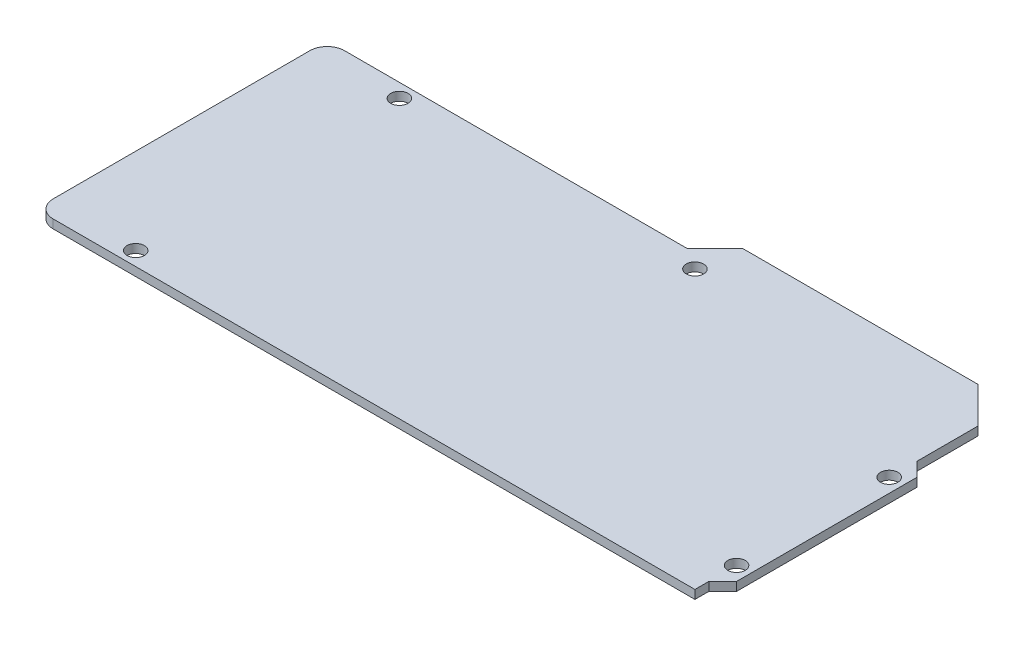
ISO-10303-21;
HEADER;
FILE_DESCRIPTION(('STEP AP214'),'2;1');
FILE_NAME('part.step','',(''),(''),'','','');
FILE_SCHEMA(('AUTOMOTIVE_DESIGN { 1 0 10303 214 1 1 1 1 }'));
ENDSEC;
DATA;
#1=APPLICATION_CONTEXT('core data for automotive mechanical design processes');
#2=APPLICATION_PROTOCOL_DEFINITION('international standard','automotive_design',2000,#1);
#3=PRODUCT_CONTEXT('',#1,'mechanical');
#4=PRODUCT('Part','Part','',(#3));
#5=PRODUCT_RELATED_PRODUCT_CATEGORY('part','',(#4));
#6=PRODUCT_DEFINITION_FORMATION('','',#4);
#7=PRODUCT_DEFINITION_CONTEXT('part definition',#1,'design');
#8=PRODUCT_DEFINITION('design','',#6,#7);
#9=PRODUCT_DEFINITION_SHAPE('','',#8);
#10=(LENGTH_UNIT() NAMED_UNIT(*) SI_UNIT(.MILLI.,.METRE.));
#11=(NAMED_UNIT(*) PLANE_ANGLE_UNIT() SI_UNIT($,.RADIAN.));
#12=(NAMED_UNIT(*) SI_UNIT($,.STERADIAN.) SOLID_ANGLE_UNIT());
#13=UNCERTAINTY_MEASURE_WITH_UNIT(LENGTH_MEASURE(1.E-05),#10,'distance_accuracy_value','');
#14=(GEOMETRIC_REPRESENTATION_CONTEXT(3) GLOBAL_UNCERTAINTY_ASSIGNED_CONTEXT((#13)) GLOBAL_UNIT_ASSIGNED_CONTEXT((#10,
#11,#12)) REPRESENTATION_CONTEXT('',''));
#15=CARTESIAN_POINT('',(0.,0.,0.));
#16=DIRECTION('',(0.,0.,1.));
#17=DIRECTION('',(1.,0.,0.));
#18=AXIS2_PLACEMENT_3D('',#15,#16,#17);
#19=CARTESIAN_POINT('',(3.175,1.5875,-3.175));
#20=DIRECTION('',(0.,-1.,0.));
#21=DIRECTION('',(0.,0.,-1.));
#22=AXIS2_PLACEMENT_3D('',#19,#20,#21);
#23=CYLINDRICAL_SURFACE('',#22,3.175);
#24=CARTESIAN_POINT('',(3.175,0.,-3.175));
#25=DIRECTION('',(0.,1.,0.));
#26=DIRECTION('',(0.,0.,-1.));
#27=AXIS2_PLACEMENT_3D('',#24,#25,#26);
#28=CIRCLE('',#27,3.175);
#29=CARTESIAN_POINT('',(0.,0.,-3.17500000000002));
#30=VERTEX_POINT('',#29);
#31=CARTESIAN_POINT('',(3.17500000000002,0.,0.));
#32=VERTEX_POINT('',#31);
#33=EDGE_CURVE('E157',#30,#32,#28,.T.);
#34=ORIENTED_EDGE('',*,*,#33,.T.);
#35=DIRECTION('',(0.,-1.,0.));
#36=VECTOR('',#35,1.);
#37=CARTESIAN_POINT('',(3.17500000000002,1.5875,0.));
#38=LINE('',#37,#36);
#39=CARTESIAN_POINT('',(3.17500000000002,1.5875,0.));
#40=VERTEX_POINT('',#39);
#41=EDGE_CURVE('E11',#40,#32,#38,.T.);
#42=ORIENTED_EDGE('',*,*,#41,.F.);
#43=CARTESIAN_POINT('',(3.175,1.5875,-3.175));
#44=DIRECTION('',(0.,1.,0.));
#45=DIRECTION('',(0.,0.,-1.));
#46=AXIS2_PLACEMENT_3D('',#43,#44,#45);
#47=CIRCLE('',#46,3.175);
#48=CARTESIAN_POINT('',(0.,1.5875,-3.17500000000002));
#49=VERTEX_POINT('',#48);
#50=EDGE_CURVE('E182',#49,#40,#47,.T.);
#51=ORIENTED_EDGE('',*,*,#50,.F.);
#52=DIRECTION('',(0.,-1.,0.));
#53=VECTOR('',#52,1.);
#54=CARTESIAN_POINT('',(0.,1.5875,-3.17500000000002));
#55=LINE('',#54,#53);
#56=EDGE_CURVE('E153',#49,#30,#55,.T.);
#57=ORIENTED_EDGE('',*,*,#56,.T.);
#58=EDGE_LOOP('',(#34,#42,#51,#57));
#59=FACE_BOUND('',#58,.T.);
#60=ADVANCED_FACE('F31',(#59),#23,.T.);
#61=CARTESIAN_POINT('',(3.17500000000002,1.5875,0.));
#62=DIRECTION('',(0.,0.,-1.));
#63=DIRECTION('',(-1.,0.,0.));
#64=AXIS2_PLACEMENT_3D('',#61,#62,#63);
#65=PLANE('',#64);
#66=DIRECTION('',(1.,0.,0.));
#67=VECTOR('',#66,1.);
#68=CARTESIAN_POINT('',(3.17500000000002,0.,0.));
#69=LINE('',#68,#67);
#70=CARTESIAN_POINT('',(120.65,0.,0.));
#71=VERTEX_POINT('',#70);
#72=EDGE_CURVE('E160',#32,#71,#69,.T.);
#73=ORIENTED_EDGE('',*,*,#72,.T.);
#74=DIRECTION('',(0.,-1.,0.));
#75=VECTOR('',#74,1.);
#76=CARTESIAN_POINT('',(120.65,1.5875,0.));
#77=LINE('',#76,#75);
#78=CARTESIAN_POINT('',(120.65,1.5875,0.));
#79=VERTEX_POINT('',#78);
#80=EDGE_CURVE('E39',#79,#71,#77,.T.);
#81=ORIENTED_EDGE('',*,*,#80,.F.);
#82=DIRECTION('',(1.,0.,0.));
#83=VECTOR('',#82,1.);
#84=CARTESIAN_POINT('',(3.17500000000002,1.5875,0.));
#85=LINE('',#84,#83);
#86=EDGE_CURVE('E105',#40,#79,#85,.T.);
#87=ORIENTED_EDGE('',*,*,#86,.F.);
#88=ORIENTED_EDGE('',*,*,#41,.T.);
#89=EDGE_LOOP('',(#73,#81,#87,#88));
#90=FACE_BOUND('',#89,.T.);
#91=ADVANCED_FACE('F266',(#90),#65,.F.);
#92=CARTESIAN_POINT('',(120.65,1.5875,0.));
#93=DIRECTION('',(-1.,0.,0.));
#94=DIRECTION('',(0.,0.,1.));
#95=AXIS2_PLACEMENT_3D('',#92,#93,#94);
#96=PLANE('',#95);
#97=DIRECTION('',(0.,0.,-1.));
#98=VECTOR('',#97,1.);
#99=CARTESIAN_POINT('',(120.65,0.,0.));
#100=LINE('',#99,#98);
#101=CARTESIAN_POINT('',(120.65,0.,-2.54));
#102=VERTEX_POINT('',#101);
#103=EDGE_CURVE('E163',#71,#102,#100,.T.);
#104=ORIENTED_EDGE('',*,*,#103,.T.);
#105=DIRECTION('',(0.,-1.,0.));
#106=VECTOR('',#105,1.);
#107=CARTESIAN_POINT('',(120.65,1.5875,-2.54));
#108=LINE('',#107,#106);
#109=CARTESIAN_POINT('',(120.65,1.5875,-2.54));
#110=VERTEX_POINT('',#109);
#111=EDGE_CURVE('E204',#110,#102,#108,.T.);
#112=ORIENTED_EDGE('',*,*,#111,.F.);
#113=DIRECTION('',(0.,0.,-1.));
#114=VECTOR('',#113,1.);
#115=CARTESIAN_POINT('',(120.65,1.5875,0.));
#116=LINE('',#115,#114);
#117=EDGE_CURVE('E212',#79,#110,#116,.T.);
#118=ORIENTED_EDGE('',*,*,#117,.F.);
#119=ORIENTED_EDGE('',*,*,#80,.T.);
#120=EDGE_LOOP('',(#104,#112,#118,#119));
#121=FACE_BOUND('',#120,.T.);
#122=ADVANCED_FACE('F210',(#121),#96,.F.);
#123=CARTESIAN_POINT('',(120.65,1.5875,-2.54));
#124=DIRECTION('',(-0.707106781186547,0.,-0.707106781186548));
#125=DIRECTION('',(-0.707106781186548,0.,0.707106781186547));
#126=AXIS2_PLACEMENT_3D('',#123,#124,#125);
#127=PLANE('',#126);
#128=DIRECTION('',(0.707106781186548,0.,-0.707106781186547));
#129=VECTOR('',#128,1.);
#130=CARTESIAN_POINT('',(120.65,0.,-2.54));
#131=LINE('',#130,#129);
#132=CARTESIAN_POINT('',(123.19,0.,-5.08));
#133=VERTEX_POINT('',#132);
#134=EDGE_CURVE('E165',#102,#133,#131,.T.);
#135=ORIENTED_EDGE('',*,*,#134,.T.);
#136=DIRECTION('',(0.,-1.,0.));
#137=VECTOR('',#136,1.);
#138=CARTESIAN_POINT('',(123.19,1.5875,-5.08));
#139=LINE('',#138,#137);
#140=CARTESIAN_POINT('',(123.19,1.5875,-5.08));
#141=VERTEX_POINT('',#140);
#142=EDGE_CURVE('E201',#141,#133,#139,.T.);
#143=ORIENTED_EDGE('',*,*,#142,.F.);
#144=DIRECTION('',(0.707106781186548,0.,-0.707106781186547));
#145=VECTOR('',#144,1.);
#146=CARTESIAN_POINT('',(120.65,1.5875,-2.54));
#147=LINE('',#146,#145);
#148=EDGE_CURVE('E230',#110,#141,#147,.T.);
#149=ORIENTED_EDGE('',*,*,#148,.F.);
#150=ORIENTED_EDGE('',*,*,#111,.T.);
#151=EDGE_LOOP('',(#135,#143,#149,#150));
#152=FACE_BOUND('',#151,.T.);
#153=ADVANCED_FACE('F221',(#152),#127,.F.);
#154=CARTESIAN_POINT('',(123.19,1.5875,-5.08));
#155=DIRECTION('',(-1.,0.,0.));
#156=DIRECTION('',(0.,0.,1.));
#157=AXIS2_PLACEMENT_3D('',#154,#155,#156);
#158=PLANE('',#157);
#159=DIRECTION('',(0.,0.,-1.));
#160=VECTOR('',#159,1.);
#161=CARTESIAN_POINT('',(123.19,0.,-5.08));
#162=LINE('',#161,#160);
#163=CARTESIAN_POINT('',(123.19,0.,-38.1));
#164=VERTEX_POINT('',#163);
#165=EDGE_CURVE('E167',#133,#164,#162,.T.);
#166=ORIENTED_EDGE('',*,*,#165,.T.);
#167=DIRECTION('',(0.,-1.,0.));
#168=VECTOR('',#167,1.);
#169=CARTESIAN_POINT('',(123.19,1.5875,-38.1));
#170=LINE('',#169,#168);
#171=CARTESIAN_POINT('',(123.19,1.5875,-38.1));
#172=VERTEX_POINT('',#171);
#173=EDGE_CURVE('E198',#172,#164,#170,.T.);
#174=ORIENTED_EDGE('',*,*,#173,.F.);
#175=DIRECTION('',(0.,0.,-1.));
#176=VECTOR('',#175,1.);
#177=CARTESIAN_POINT('',(123.19,1.5875,-5.08));
#178=LINE('',#177,#176);
#179=EDGE_CURVE('E227',#141,#172,#178,.T.);
#180=ORIENTED_EDGE('',*,*,#179,.F.);
#181=ORIENTED_EDGE('',*,*,#142,.T.);
#182=EDGE_LOOP('',(#166,#174,#180,#181));
#183=FACE_BOUND('',#182,.T.);
#184=ADVANCED_FACE('F225',(#183),#158,.F.);
#185=CARTESIAN_POINT('',(123.19,1.5875,-38.1));
#186=DIRECTION('',(-0.707106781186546,0.,0.707106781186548));
#187=DIRECTION('',(0.707106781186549,0.,0.707106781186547));
#188=AXIS2_PLACEMENT_3D('',#185,#186,#187);
#189=PLANE('',#188);
#190=DIRECTION('',(-0.707106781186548,0.,-0.707106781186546));
#191=VECTOR('',#190,1.);
#192=CARTESIAN_POINT('',(123.19,0.,-38.1));
#193=LINE('',#192,#191);
#194=CARTESIAN_POINT('',(120.65,0.,-40.64));
#195=VERTEX_POINT('',#194);
#196=EDGE_CURVE('E169',#164,#195,#193,.T.);
#197=ORIENTED_EDGE('',*,*,#196,.T.);
#198=DIRECTION('',(0.,-1.,0.));
#199=VECTOR('',#198,1.);
#200=CARTESIAN_POINT('',(120.65,1.5875,-40.64));
#201=LINE('',#200,#199);
#202=CARTESIAN_POINT('',(120.65,1.5875,-40.64));
#203=VERTEX_POINT('',#202);
#204=EDGE_CURVE('E195',#203,#195,#201,.T.);
#205=ORIENTED_EDGE('',*,*,#204,.F.);
#206=DIRECTION('',(-0.707106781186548,0.,-0.707106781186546));
#207=VECTOR('',#206,1.);
#208=CARTESIAN_POINT('',(123.19,1.5875,-38.1));
#209=LINE('',#208,#207);
#210=EDGE_CURVE('E229',#172,#203,#209,.T.);
#211=ORIENTED_EDGE('',*,*,#210,.F.);
#212=ORIENTED_EDGE('',*,*,#173,.T.);
#213=EDGE_LOOP('',(#197,#205,#211,#212));
#214=FACE_BOUND('',#213,.T.);
#215=ADVANCED_FACE('F279',(#214),#189,.F.);
#216=CARTESIAN_POINT('',(120.65,1.5875,-40.64));
#217=DIRECTION('',(-1.,0.,0.));
#218=DIRECTION('',(0.,0.,1.));
#219=AXIS2_PLACEMENT_3D('',#216,#217,#218);
#220=PLANE('',#219);
#221=DIRECTION('',(0.,0.,-1.));
#222=VECTOR('',#221,1.);
#223=CARTESIAN_POINT('',(120.65,0.,-40.64));
#224=LINE('',#223,#222);
#225=CARTESIAN_POINT('',(120.65,0.,-51.816));
#226=VERTEX_POINT('',#225);
#227=EDGE_CURVE('E171',#195,#226,#224,.T.);
#228=ORIENTED_EDGE('',*,*,#227,.T.);
#229=DIRECTION('',(0.,-1.,0.));
#230=VECTOR('',#229,1.);
#231=CARTESIAN_POINT('',(120.65,1.5875,-51.816));
#232=LINE('',#231,#230);
#233=CARTESIAN_POINT('',(120.65,1.5875,-51.816));
#234=VERTEX_POINT('',#233);
#235=EDGE_CURVE('E192',#234,#226,#232,.T.);
#236=ORIENTED_EDGE('',*,*,#235,.F.);
#237=DIRECTION('',(0.,0.,-1.));
#238=VECTOR('',#237,1.);
#239=CARTESIAN_POINT('',(120.65,1.5875,-40.64));
#240=LINE('',#239,#238);
#241=EDGE_CURVE('E232',#203,#234,#240,.T.);
#242=ORIENTED_EDGE('',*,*,#241,.F.);
#243=ORIENTED_EDGE('',*,*,#204,.T.);
#244=EDGE_LOOP('',(#228,#236,#242,#243));
#245=FACE_BOUND('',#244,.T.);
#246=ADVANCED_FACE('F282',(#245),#220,.F.);
#247=CARTESIAN_POINT('',(120.65,1.5875,-51.816));
#248=DIRECTION('',(-0.707106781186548,0.,0.707106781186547));
#249=DIRECTION('',(0.707106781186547,0.,0.707106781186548));
#250=AXIS2_PLACEMENT_3D('',#247,#248,#249);
#251=PLANE('',#250);
#252=DIRECTION('',(-0.707106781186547,0.,-0.707106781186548));
#253=VECTOR('',#252,1.);
#254=CARTESIAN_POINT('',(120.65,0.,-51.816));
#255=LINE('',#254,#253);
#256=CARTESIAN_POINT('',(114.046,0.,-58.42));
#257=VERTEX_POINT('',#256);
#258=EDGE_CURVE('E173',#226,#257,#255,.T.);
#259=ORIENTED_EDGE('',*,*,#258,.T.);
#260=DIRECTION('',(0.,-1.,0.));
#261=VECTOR('',#260,1.);
#262=CARTESIAN_POINT('',(114.046,1.5875,-58.42));
#263=LINE('',#262,#261);
#264=CARTESIAN_POINT('',(114.046,1.5875,-58.42));
#265=VERTEX_POINT('',#264);
#266=EDGE_CURVE('E189',#265,#257,#263,.T.);
#267=ORIENTED_EDGE('',*,*,#266,.F.);
#268=DIRECTION('',(-0.707106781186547,0.,-0.707106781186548));
#269=VECTOR('',#268,1.);
#270=CARTESIAN_POINT('',(120.65,1.5875,-51.816));
#271=LINE('',#270,#269);
#272=EDGE_CURVE('E238',#234,#265,#271,.T.);
#273=ORIENTED_EDGE('',*,*,#272,.F.);
#274=ORIENTED_EDGE('',*,*,#235,.T.);
#275=EDGE_LOOP('',(#259,#267,#273,#274));
#276=FACE_BOUND('',#275,.T.);
#277=ADVANCED_FACE('F286',(#276),#251,.F.);
#278=CARTESIAN_POINT('',(114.046,1.5875,-58.42));
#279=DIRECTION('',(0.,0.,1.));
#280=DIRECTION('',(1.,0.,0.));
#281=AXIS2_PLACEMENT_3D('',#278,#279,#280);
#282=PLANE('',#281);
#283=DIRECTION('',(-1.,0.,0.));
#284=VECTOR('',#283,1.);
#285=CARTESIAN_POINT('',(114.046,0.,-58.42));
#286=LINE('',#285,#284);
#287=CARTESIAN_POINT('',(70.993,0.,-58.42));
#288=VERTEX_POINT('',#287);
#289=EDGE_CURVE('E175',#257,#288,#286,.T.);
#290=ORIENTED_EDGE('',*,*,#289,.T.);
#291=DIRECTION('',(0.,-1.,0.));
#292=VECTOR('',#291,1.);
#293=CARTESIAN_POINT('',(70.993,1.5875,-58.42));
#294=LINE('',#293,#292);
#295=CARTESIAN_POINT('',(70.993,1.5875,-58.42));
#296=VERTEX_POINT('',#295);
#297=EDGE_CURVE('E186',#296,#288,#294,.T.);
#298=ORIENTED_EDGE('',*,*,#297,.F.);
#299=DIRECTION('',(-1.,0.,0.));
#300=VECTOR('',#299,1.);
#301=CARTESIAN_POINT('',(114.046,1.5875,-58.42));
#302=LINE('',#301,#300);
#303=EDGE_CURVE('E240',#265,#296,#302,.T.);
#304=ORIENTED_EDGE('',*,*,#303,.F.);
#305=ORIENTED_EDGE('',*,*,#266,.T.);
#306=EDGE_LOOP('',(#290,#298,#304,#305));
#307=FACE_BOUND('',#306,.T.);
#308=ADVANCED_FACE('F246',(#307),#282,.F.);
#309=CARTESIAN_POINT('',(70.993,1.5875,-58.42));
#310=DIRECTION('',(0.707106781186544,0.,0.707106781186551));
#311=DIRECTION('',(0.707106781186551,0.,-0.707106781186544));
#312=AXIS2_PLACEMENT_3D('',#309,#310,#311);
#313=PLANE('',#312);
#314=DIRECTION('',(-0.707106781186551,0.,0.707106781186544));
#315=VECTOR('',#314,1.);
#316=CARTESIAN_POINT('',(70.993,0.,-58.42));
#317=LINE('',#316,#315);
#318=CARTESIAN_POINT('',(65.9129999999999,0.,-53.34));
#319=VERTEX_POINT('',#318);
#320=EDGE_CURVE('E177',#288,#319,#317,.T.);
#321=ORIENTED_EDGE('',*,*,#320,.T.);
#322=DIRECTION('',(0.,-1.,0.));
#323=VECTOR('',#322,1.);
#324=CARTESIAN_POINT('',(65.9129999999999,1.5875,-53.34));
#325=LINE('',#324,#323);
#326=CARTESIAN_POINT('',(65.9129999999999,1.5875,-53.34));
#327=VERTEX_POINT('',#326);
#328=EDGE_CURVE('E148',#327,#319,#325,.T.);
#329=ORIENTED_EDGE('',*,*,#328,.F.);
#330=DIRECTION('',(-0.707106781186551,0.,0.707106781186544));
#331=VECTOR('',#330,1.);
#332=CARTESIAN_POINT('',(70.993,1.5875,-58.42));
#333=LINE('',#332,#331);
#334=EDGE_CURVE('E139',#296,#327,#333,.T.);
#335=ORIENTED_EDGE('',*,*,#334,.F.);
#336=ORIENTED_EDGE('',*,*,#297,.T.);
#337=EDGE_LOOP('',(#321,#329,#335,#336));
#338=FACE_BOUND('',#337,.T.);
#339=ADVANCED_FACE('F250',(#338),#313,.F.);
#340=CARTESIAN_POINT('',(3.17500000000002,1.5875,-53.34));
#341=DIRECTION('',(0.,0.,1.));
#342=DIRECTION('',(1.,0.,0.));
#343=AXIS2_PLACEMENT_3D('',#340,#341,#342);
#344=PLANE('',#343);
#345=DIRECTION('',(-1.,0.,0.));
#346=VECTOR('',#345,1.);
#347=CARTESIAN_POINT('',(3.17500000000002,0.,-53.34));
#348=LINE('',#347,#346);
#349=CARTESIAN_POINT('',(3.17500000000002,0.,-53.34));
#350=VERTEX_POINT('',#349);
#351=EDGE_CURVE('E147',#319,#350,#348,.T.);
#352=ORIENTED_EDGE('',*,*,#351,.T.);
#353=DIRECTION('',(0.,-1.,0.));
#354=VECTOR('',#353,1.);
#355=CARTESIAN_POINT('',(3.17500000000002,1.5875,-53.34));
#356=LINE('',#355,#354);
#357=CARTESIAN_POINT('',(3.17500000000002,1.5875,-53.34));
#358=VERTEX_POINT('',#357);
#359=EDGE_CURVE('E144',#358,#350,#356,.T.);
#360=ORIENTED_EDGE('',*,*,#359,.F.);
#361=DIRECTION('',(-1.,0.,0.));
#362=VECTOR('',#361,1.);
#363=CARTESIAN_POINT('',(3.17500000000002,1.5875,-53.34));
#364=LINE('',#363,#362);
#365=EDGE_CURVE('E133',#327,#358,#364,.T.);
#366=ORIENTED_EDGE('',*,*,#365,.F.);
#367=ORIENTED_EDGE('',*,*,#328,.T.);
#368=EDGE_LOOP('',(#352,#360,#366,#367));
#369=FACE_BOUND('',#368,.T.);
#370=ADVANCED_FACE('F145',(#369),#344,.F.);
#371=CARTESIAN_POINT('',(3.175,1.5875,-50.165));
#372=DIRECTION('',(0.,-1.,0.));
#373=DIRECTION('',(0.,0.,-1.));
#374=AXIS2_PLACEMENT_3D('',#371,#372,#373);
#375=CYLINDRICAL_SURFACE('',#374,3.175);
#376=CARTESIAN_POINT('',(3.175,0.,-50.165));
#377=DIRECTION('',(0.,1.,0.));
#378=DIRECTION('',(0.,0.,-1.));
#379=AXIS2_PLACEMENT_3D('',#376,#377,#378);
#380=CIRCLE('',#379,3.175);
#381=CARTESIAN_POINT('',(0.,0.,-50.165));
#382=VERTEX_POINT('',#381);
#383=EDGE_CURVE('E91',#350,#382,#380,.T.);
#384=ORIENTED_EDGE('',*,*,#383,.T.);
#385=DIRECTION('',(0.,-1.,0.));
#386=VECTOR('',#385,1.);
#387=CARTESIAN_POINT('',(0.,1.5875,-50.165));
#388=LINE('',#387,#386);
#389=CARTESIAN_POINT('',(0.,1.5875,-50.165));
#390=VERTEX_POINT('',#389);
#391=EDGE_CURVE('E149',#390,#382,#388,.T.);
#392=ORIENTED_EDGE('',*,*,#391,.F.);
#393=CARTESIAN_POINT('',(3.175,1.5875,-50.165));
#394=DIRECTION('',(0.,1.,0.));
#395=DIRECTION('',(0.,0.,-1.));
#396=AXIS2_PLACEMENT_3D('',#393,#394,#395);
#397=CIRCLE('',#396,3.175);
#398=EDGE_CURVE('E137',#358,#390,#397,.T.);
#399=ORIENTED_EDGE('',*,*,#398,.F.);
#400=ORIENTED_EDGE('',*,*,#359,.T.);
#401=EDGE_LOOP('',(#384,#392,#399,#400));
#402=FACE_BOUND('',#401,.T.);
#403=ADVANCED_FACE('F151',(#402),#375,.T.);
#404=CARTESIAN_POINT('',(0.,1.5875,-3.17500000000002));
#405=DIRECTION('',(1.,0.,0.));
#406=DIRECTION('',(0.,0.,-1.));
#407=AXIS2_PLACEMENT_3D('',#404,#405,#406);
#408=PLANE('',#407);
#409=DIRECTION('',(0.,0.,1.));
#410=VECTOR('',#409,1.);
#411=CARTESIAN_POINT('',(0.,0.,-3.17500000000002));
#412=LINE('',#411,#410);
#413=EDGE_CURVE('E97',#382,#30,#412,.T.);
#414=ORIENTED_EDGE('',*,*,#413,.T.);
#415=ORIENTED_EDGE('',*,*,#56,.F.);
#416=DIRECTION('',(0.,0.,1.));
#417=VECTOR('',#416,1.);
#418=CARTESIAN_POINT('',(0.,1.5875,-3.17500000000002));
#419=LINE('',#418,#417);
#420=EDGE_CURVE('E47',#390,#49,#419,.T.);
#421=ORIENTED_EDGE('',*,*,#420,.F.);
#422=ORIENTED_EDGE('',*,*,#391,.T.);
#423=EDGE_LOOP('',(#414,#415,#421,#422));
#424=FACE_BOUND('',#423,.T.);
#425=ADVANCED_FACE('F254',(#424),#408,.F.);
#426=CARTESIAN_POINT('',(3.175,1.5875,-3.175));
#427=DIRECTION('',(0.,-1.,0.));
#428=DIRECTION('',(0.,0.,-1.));
#429=AXIS2_PLACEMENT_3D('',#426,#427,#428);
#430=PLANE('',#429);
#431=CARTESIAN_POINT('',(15.748,1.5875,-50.8));
#432=DIRECTION('',(0.,1.,0.));
#433=DIRECTION('',(0.,0.,1.));
#434=AXIS2_PLACEMENT_3D('',#431,#432,#433);
#435=CIRCLE('',#434,1.58749999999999);
#436=CARTESIAN_POINT('',(15.748,1.5875,-49.2125));
#437=VERTEX_POINT('',#436);
#438=EDGE_CURVE('E382',#437,#437,#435,.T.);
#439=ORIENTED_EDGE('',*,*,#438,.F.);
#440=EDGE_LOOP('',(#439));
#441=FACE_BOUND('',#440,.T.);
#442=CARTESIAN_POINT('',(15.748,1.5875,-2.54));
#443=DIRECTION('',(0.,1.,0.));
#444=DIRECTION('',(0.,0.,1.));
#445=AXIS2_PLACEMENT_3D('',#442,#443,#444);
#446=CIRCLE('',#445,1.58749999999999);
#447=CARTESIAN_POINT('',(15.748,1.5875,-0.952500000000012));
#448=VERTEX_POINT('',#447);
#449=EDGE_CURVE('E384',#448,#448,#446,.T.);
#450=ORIENTED_EDGE('',*,*,#449,.F.);
#451=EDGE_LOOP('',(#450));
#452=FACE_BOUND('',#451,.T.);
#453=CARTESIAN_POINT('',(69.85,1.5875,-50.8));
#454=DIRECTION('',(0.,1.,0.));
#455=DIRECTION('',(0.,0.,1.));
#456=AXIS2_PLACEMENT_3D('',#453,#454,#455);
#457=CIRCLE('',#456,1.58749999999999);
#458=CARTESIAN_POINT('',(69.85,1.5875,-49.2125));
#459=VERTEX_POINT('',#458);
#460=EDGE_CURVE('E392',#459,#459,#457,.T.);
#461=ORIENTED_EDGE('',*,*,#460,.F.);
#462=EDGE_LOOP('',(#461));
#463=FACE_BOUND('',#462,.T.);
#464=CARTESIAN_POINT('',(120.65,1.5875,-35.56));
#465=DIRECTION('',(0.,1.,0.));
#466=DIRECTION('',(0.,0.,1.));
#467=AXIS2_PLACEMENT_3D('',#464,#465,#466);
#468=CIRCLE('',#467,1.58749999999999);
#469=CARTESIAN_POINT('',(120.65,1.5875,-33.9725));
#470=VERTEX_POINT('',#469);
#471=EDGE_CURVE('E398',#470,#470,#468,.T.);
#472=ORIENTED_EDGE('',*,*,#471,.F.);
#473=EDGE_LOOP('',(#472));
#474=FACE_BOUND('',#473,.T.);
#475=CARTESIAN_POINT('',(120.65,1.5875,-7.62));
#476=DIRECTION('',(0.,1.,0.));
#477=DIRECTION('',(0.,0.,1.));
#478=AXIS2_PLACEMENT_3D('',#475,#476,#477);
#479=CIRCLE('',#478,1.58749999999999);
#480=CARTESIAN_POINT('',(120.65,1.5875,-6.03250000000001));
#481=VERTEX_POINT('',#480);
#482=EDGE_CURVE('E404',#481,#481,#479,.T.);
#483=ORIENTED_EDGE('',*,*,#482,.F.);
#484=EDGE_LOOP('',(#483));
#485=FACE_BOUND('',#484,.T.);
#486=ORIENTED_EDGE('',*,*,#50,.T.);
#487=ORIENTED_EDGE('',*,*,#86,.T.);
#488=ORIENTED_EDGE('',*,*,#117,.T.);
#489=ORIENTED_EDGE('',*,*,#148,.T.);
#490=ORIENTED_EDGE('',*,*,#179,.T.);
#491=ORIENTED_EDGE('',*,*,#210,.T.);
#492=ORIENTED_EDGE('',*,*,#241,.T.);
#493=ORIENTED_EDGE('',*,*,#272,.T.);
#494=ORIENTED_EDGE('',*,*,#303,.T.);
#495=ORIENTED_EDGE('',*,*,#334,.T.);
#496=ORIENTED_EDGE('',*,*,#365,.T.);
#497=ORIENTED_EDGE('',*,*,#398,.T.);
#498=ORIENTED_EDGE('',*,*,#420,.T.);
#499=EDGE_LOOP('',(#486,#487,#488,#489,#490,#491,#492,#493,#494,#495,#496,#497,#498));
#500=FACE_BOUND('',#499,.T.);
#501=ADVANCED_FACE('F135',(#441,#452,#463,#474,#485,#500),#430,.F.);
#502=CARTESIAN_POINT('',(3.175,0.,-3.175));
#503=DIRECTION('',(0.,-1.,0.));
#504=DIRECTION('',(0.,0.,-1.));
#505=AXIS2_PLACEMENT_3D('',#502,#503,#504);
#506=PLANE('',#505);
#507=CARTESIAN_POINT('',(15.748,0.,-50.8));
#508=DIRECTION('',(0.,1.,0.));
#509=DIRECTION('',(0.,0.,1.));
#510=AXIS2_PLACEMENT_3D('',#507,#508,#509);
#511=CIRCLE('',#510,1.5875);
#512=CARTESIAN_POINT('',(15.748,0.,-49.2125));
#513=VERTEX_POINT('',#512);
#514=EDGE_CURVE('E379',#513,#513,#511,.T.);
#515=ORIENTED_EDGE('',*,*,#514,.T.);
#516=EDGE_LOOP('',(#515));
#517=FACE_BOUND('',#516,.T.);
#518=CARTESIAN_POINT('',(15.748,0.,-2.54));
#519=DIRECTION('',(0.,1.,0.));
#520=DIRECTION('',(0.,0.,1.));
#521=AXIS2_PLACEMENT_3D('',#518,#519,#520);
#522=CIRCLE('',#521,1.5875);
#523=CARTESIAN_POINT('',(15.748,0.,-0.952500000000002));
#524=VERTEX_POINT('',#523);
#525=EDGE_CURVE('E389',#524,#524,#522,.T.);
#526=ORIENTED_EDGE('',*,*,#525,.T.);
#527=EDGE_LOOP('',(#526));
#528=FACE_BOUND('',#527,.T.);
#529=CARTESIAN_POINT('',(69.85,0.,-50.8));
#530=DIRECTION('',(0.,1.,0.));
#531=DIRECTION('',(0.,0.,1.));
#532=AXIS2_PLACEMENT_3D('',#529,#530,#531);
#533=CIRCLE('',#532,1.58749999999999);
#534=CARTESIAN_POINT('',(69.85,0.,-49.2125));
#535=VERTEX_POINT('',#534);
#536=EDGE_CURVE('E395',#535,#535,#533,.T.);
#537=ORIENTED_EDGE('',*,*,#536,.T.);
#538=EDGE_LOOP('',(#537));
#539=FACE_BOUND('',#538,.T.);
#540=CARTESIAN_POINT('',(120.65,0.,-35.56));
#541=DIRECTION('',(0.,1.,0.));
#542=DIRECTION('',(0.,0.,1.));
#543=AXIS2_PLACEMENT_3D('',#540,#541,#542);
#544=CIRCLE('',#543,1.58749999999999);
#545=CARTESIAN_POINT('',(120.65,0.,-33.9725));
#546=VERTEX_POINT('',#545);
#547=EDGE_CURVE('E401',#546,#546,#544,.T.);
#548=ORIENTED_EDGE('',*,*,#547,.T.);
#549=EDGE_LOOP('',(#548));
#550=FACE_BOUND('',#549,.T.);
#551=CARTESIAN_POINT('',(120.65,0.,-7.62));
#552=DIRECTION('',(0.,1.,0.));
#553=DIRECTION('',(0.,0.,1.));
#554=AXIS2_PLACEMENT_3D('',#551,#552,#553);
#555=CIRCLE('',#554,1.58749999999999);
#556=CARTESIAN_POINT('',(120.65,0.,-6.03250000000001));
#557=VERTEX_POINT('',#556);
#558=EDGE_CURVE('E161',#557,#557,#555,.T.);
#559=ORIENTED_EDGE('',*,*,#558,.T.);
#560=EDGE_LOOP('',(#559));
#561=FACE_BOUND('',#560,.T.);
#562=ORIENTED_EDGE('',*,*,#33,.F.);
#563=ORIENTED_EDGE('',*,*,#413,.F.);
#564=ORIENTED_EDGE('',*,*,#383,.F.);
#565=ORIENTED_EDGE('',*,*,#351,.F.);
#566=ORIENTED_EDGE('',*,*,#320,.F.);
#567=ORIENTED_EDGE('',*,*,#289,.F.);
#568=ORIENTED_EDGE('',*,*,#258,.F.);
#569=ORIENTED_EDGE('',*,*,#227,.F.);
#570=ORIENTED_EDGE('',*,*,#196,.F.);
#571=ORIENTED_EDGE('',*,*,#165,.F.);
#572=ORIENTED_EDGE('',*,*,#134,.F.);
#573=ORIENTED_EDGE('',*,*,#103,.F.);
#574=ORIENTED_EDGE('',*,*,#72,.F.);
#575=EDGE_LOOP('',(#562,#563,#564,#565,#566,#567,#568,#569,#570,#571,#572,#573,#574));
#576=FACE_BOUND('',#575,.T.);
#577=ADVANCED_FACE('F216',(#517,#528,#539,#550,#561,#576),#506,.T.);
#578=CARTESIAN_POINT('',(120.65,1.5875,-7.62));
#579=DIRECTION('',(0.,1.,0.));
#580=DIRECTION('',(0.,0.,1.));
#581=AXIS2_PLACEMENT_3D('',#578,#579,#580);
#582=CYLINDRICAL_SURFACE('',#581,1.58749999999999);
#583=ORIENTED_EDGE('',*,*,#558,.F.);
#584=EDGE_LOOP('',(#583));
#585=FACE_BOUND('',#584,.T.);
#586=ORIENTED_EDGE('',*,*,#482,.T.);
#587=EDGE_LOOP('',(#586));
#588=FACE_BOUND('',#587,.T.);
#589=ADVANCED_FACE('F323',(#585,#588),#582,.F.);
#590=CARTESIAN_POINT('',(120.65,1.5875,-35.56));
#591=DIRECTION('',(0.,1.,0.));
#592=DIRECTION('',(0.,0.,1.));
#593=AXIS2_PLACEMENT_3D('',#590,#591,#592);
#594=CYLINDRICAL_SURFACE('',#593,1.58749999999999);
#595=ORIENTED_EDGE('',*,*,#547,.F.);
#596=EDGE_LOOP('',(#595));
#597=FACE_BOUND('',#596,.T.);
#598=ORIENTED_EDGE('',*,*,#471,.T.);
#599=EDGE_LOOP('',(#598));
#600=FACE_BOUND('',#599,.T.);
#601=ADVANCED_FACE('F332',(#597,#600),#594,.F.);
#602=CARTESIAN_POINT('',(69.85,1.5875,-50.8));
#603=DIRECTION('',(0.,1.,0.));
#604=DIRECTION('',(0.,0.,1.));
#605=AXIS2_PLACEMENT_3D('',#602,#603,#604);
#606=CYLINDRICAL_SURFACE('',#605,1.58749999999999);
#607=ORIENTED_EDGE('',*,*,#536,.F.);
#608=EDGE_LOOP('',(#607));
#609=FACE_BOUND('',#608,.T.);
#610=ORIENTED_EDGE('',*,*,#460,.T.);
#611=EDGE_LOOP('',(#610));
#612=FACE_BOUND('',#611,.T.);
#613=ADVANCED_FACE('F342',(#609,#612),#606,.F.);
#614=CARTESIAN_POINT('',(15.748,1.5875,-2.54));
#615=DIRECTION('',(0.,1.,0.));
#616=DIRECTION('',(0.,0.,1.));
#617=AXIS2_PLACEMENT_3D('',#614,#615,#616);
#618=CYLINDRICAL_SURFACE('',#617,1.58749999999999);
#619=ORIENTED_EDGE('',*,*,#525,.F.);
#620=EDGE_LOOP('',(#619));
#621=FACE_BOUND('',#620,.T.);
#622=ORIENTED_EDGE('',*,*,#449,.T.);
#623=EDGE_LOOP('',(#622));
#624=FACE_BOUND('',#623,.T.);
#625=ADVANCED_FACE('F352',(#621,#624),#618,.F.);
#626=CARTESIAN_POINT('',(15.748,1.5875,-50.8));
#627=DIRECTION('',(0.,1.,0.));
#628=DIRECTION('',(0.,0.,1.));
#629=AXIS2_PLACEMENT_3D('',#626,#627,#628);
#630=CYLINDRICAL_SURFACE('',#629,1.58749999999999);
#631=ORIENTED_EDGE('',*,*,#514,.F.);
#632=EDGE_LOOP('',(#631));
#633=FACE_BOUND('',#632,.T.);
#634=ORIENTED_EDGE('',*,*,#438,.T.);
#635=EDGE_LOOP('',(#634));
#636=FACE_BOUND('',#635,.T.);
#637=ADVANCED_FACE('F362',(#633,#636),#630,.F.);
#638=CLOSED_SHELL('',(#60,#91,#122,#153,#184,#215,#246,#277,#308,#339,#370,#403,#425,#501,#577,
#589,#601,#613,#625,#637));
#639=MANIFOLD_SOLID_BREP('B2',#638);
#640=ADVANCED_BREP_SHAPE_REPRESENTATION('',(#18,#639),#14);
#641=SHAPE_DEFINITION_REPRESENTATION(#9,#640);
ENDSEC;
END-ISO-10303-21;
